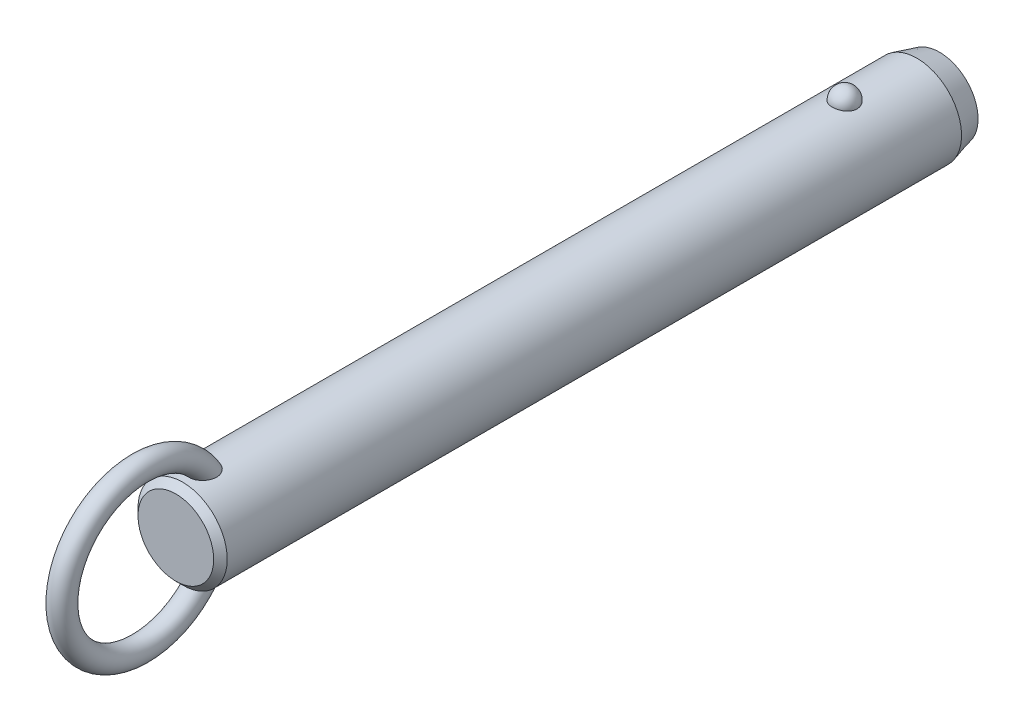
ISO-10303-21;
HEADER;
FILE_DESCRIPTION(('STEP AP214'),'2;1');
FILE_NAME('part.step','',(''),(''),'','','');
FILE_SCHEMA(('AUTOMOTIVE_DESIGN { 1 0 10303 214 1 1 1 1 }'));
ENDSEC;
DATA;
#1=APPLICATION_CONTEXT('core data for automotive mechanical design processes');
#2=APPLICATION_PROTOCOL_DEFINITION('international standard','automotive_design',2000,#1);
#3=PRODUCT_CONTEXT('',#1,'mechanical');
#4=PRODUCT('Part','Part','',(#3));
#5=PRODUCT_RELATED_PRODUCT_CATEGORY('part','',(#4));
#6=PRODUCT_DEFINITION_FORMATION('','',#4);
#7=PRODUCT_DEFINITION_CONTEXT('part definition',#1,'design');
#8=PRODUCT_DEFINITION('design','',#6,#7);
#9=PRODUCT_DEFINITION_SHAPE('','',#8);
#10=(LENGTH_UNIT() NAMED_UNIT(*) SI_UNIT(.MILLI.,.METRE.));
#11=(NAMED_UNIT(*) PLANE_ANGLE_UNIT() SI_UNIT($,.RADIAN.));
#12=(NAMED_UNIT(*) SI_UNIT($,.STERADIAN.) SOLID_ANGLE_UNIT());
#13=UNCERTAINTY_MEASURE_WITH_UNIT(LENGTH_MEASURE(1.E-05),#10,'distance_accuracy_value','');
#14=(GEOMETRIC_REPRESENTATION_CONTEXT(3) GLOBAL_UNCERTAINTY_ASSIGNED_CONTEXT((#13)) GLOBAL_UNIT_ASSIGNED_CONTEXT((#10,
#11,#12)) REPRESENTATION_CONTEXT('',''));
#15=CARTESIAN_POINT('',(0.,0.,0.));
#16=DIRECTION('',(0.,0.,1.));
#17=DIRECTION('',(1.,0.,0.));
#18=AXIS2_PLACEMENT_3D('',#15,#16,#17);
#19=CARTESIAN_POINT('',(0.,0.,106.7));
#20=DIRECTION('',(0.,0.,-1.));
#21=DIRECTION('',(-1.,0.,0.));
#22=AXIS2_PLACEMENT_3D('',#19,#20,#21);
#23=CYLINDRICAL_SURFACE('',#22,7.9);
#24=CARTESIAN_POINT('',(2.1785689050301,7.59367088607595,-2.19999999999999));
#25=CARTESIAN_POINT('',(2.17856679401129,7.59367269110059,-2.07701843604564));
#26=CARTESIAN_POINT('',(2.16853481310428,7.59657145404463,-1.95401006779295));
#27=CARTESIAN_POINT('',(2.12864689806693,7.607843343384,-1.71147811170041));
#28=CARTESIAN_POINT('',(2.09878338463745,7.61621856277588,-1.59195587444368));
#29=CARTESIAN_POINT('',(2.0199931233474,7.63749180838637,-1.3598563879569));
#30=CARTESIAN_POINT('',(1.97107475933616,7.65038784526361,-1.24727610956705));
#31=CARTESIAN_POINT('',(1.85539377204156,7.67926115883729,-1.03213234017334));
#32=CARTESIAN_POINT('',(1.78863158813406,7.69523835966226,-0.929568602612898));
#33=CARTESIAN_POINT('',(1.63856494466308,7.7285848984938,-0.736786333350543));
#34=CARTESIAN_POINT('',(1.55518140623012,7.7459606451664,-0.646630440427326));
#35=CARTESIAN_POINT('',(1.37422937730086,7.78009978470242,-0.481747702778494));
#36=CARTESIAN_POINT('',(1.27666086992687,7.7968631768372,-0.407020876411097));
#37=CARTESIAN_POINT('',(1.07024728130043,7.82786153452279,-0.275278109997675));
#38=CARTESIAN_POINT('',(0.961434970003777,7.84210353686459,-0.218212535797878));
#39=CARTESIAN_POINT('',(0.735351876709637,7.86652194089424,-0.123146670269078));
#40=CARTESIAN_POINT('',(0.618082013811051,7.87669878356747,-0.0851443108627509));
#41=CARTESIAN_POINT('',(0.380637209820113,7.89170521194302,-0.0298158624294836));
#42=CARTESIAN_POINT('',(0.260550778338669,7.89662650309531,-0.0121347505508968));
#43=CARTESIAN_POINT('',(0.0190117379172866,7.90090003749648,0.00324379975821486));
#44=CARTESIAN_POINT('',(-0.10244074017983,7.90025280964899,0.000943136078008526));
#45=CARTESIAN_POINT('',(-0.341452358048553,7.89351056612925,-0.0233955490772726));
#46=CARTESIAN_POINT('',(-0.45904225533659,7.88749257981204,-0.0451545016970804));
#47=CARTESIAN_POINT('',(-0.688796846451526,7.87075812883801,-0.107408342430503));
#48=CARTESIAN_POINT('',(-0.800961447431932,7.86004158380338,-0.147903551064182));
#49=CARTESIAN_POINT('',(-1.01743634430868,7.83497131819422,-0.246799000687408));
#50=CARTESIAN_POINT('',(-1.12169791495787,7.82059709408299,-0.305300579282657));
#51=CARTESIAN_POINT('',(-1.31891765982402,7.78976470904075,-0.438549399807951));
#52=CARTESIAN_POINT('',(-1.41187469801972,7.77330633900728,-0.513298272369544));
#53=CARTESIAN_POINT('',(-1.58577142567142,7.73972434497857,-0.678622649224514));
#54=CARTESIAN_POINT('',(-1.66645140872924,7.72259402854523,-0.769470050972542));
#55=CARTESIAN_POINT('',(-1.81161503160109,7.68983776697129,-0.963538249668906));
#56=CARTESIAN_POINT('',(-1.87609753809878,7.6742119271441,-1.06675991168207));
#57=CARTESIAN_POINT('',(-1.98790138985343,7.6460202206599,-1.28401170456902));
#58=CARTESIAN_POINT('',(-2.03501994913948,7.63349104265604,-1.39815107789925));
#59=CARTESIAN_POINT('',(-2.10986724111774,7.6131449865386,-1.63301784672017));
#60=CARTESIAN_POINT('',(-2.1375965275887,7.60532797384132,-1.75374505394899));
#61=CARTESIAN_POINT('',(-2.17289256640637,7.59531950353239,-1.99782562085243));
#62=CARTESIAN_POINT('',(-2.18054294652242,7.59310471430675,-2.12116592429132));
#63=CARTESIAN_POINT('',(-2.17572919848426,7.59448538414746,-2.36741799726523));
#64=CARTESIAN_POINT('',(-2.1632656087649,7.59808068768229,-2.49032977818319));
#65=CARTESIAN_POINT('',(-2.11865035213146,7.61064035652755,-2.73161015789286));
#66=CARTESIAN_POINT('',(-2.08659579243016,7.61957823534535,-2.84999812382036));
#67=CARTESIAN_POINT('',(-2.00367799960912,7.64179982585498,-3.07955956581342));
#68=CARTESIAN_POINT('',(-1.9528140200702,7.65508371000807,-3.19073275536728));
#69=CARTESIAN_POINT('',(-1.83321113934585,7.68460381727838,-3.40337899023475));
#70=CARTESIAN_POINT('',(-1.76437735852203,7.70085556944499,-3.50479651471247));
#71=CARTESIAN_POINT('',(-1.61069526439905,7.73445734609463,-3.69446912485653));
#72=CARTESIAN_POINT('',(-1.52584634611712,7.75180741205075,-3.78272371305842));
#73=CARTESIAN_POINT('',(-1.34198059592,7.78574608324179,-3.94393987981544));
#74=CARTESIAN_POINT('',(-1.24291308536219,7.80233167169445,-4.01684434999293));
#75=CARTESIAN_POINT('',(-1.03352039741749,7.83281625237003,-4.14489386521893));
#76=CARTESIAN_POINT('',(-0.923196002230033,7.84671543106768,-4.20004014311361));
#77=CARTESIAN_POINT('',(-0.695822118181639,7.87011575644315,-4.29042017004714));
#78=CARTESIAN_POINT('',(-0.578872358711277,7.87966903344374,-4.32589112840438));
#79=CARTESIAN_POINT('',(-0.340410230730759,7.8935652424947,-4.37692226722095));
#80=CARTESIAN_POINT('',(-0.218898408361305,7.89790879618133,-4.39248482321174));
#81=CARTESIAN_POINT('',(0.0228107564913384,7.90087453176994,-4.40314405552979));
#82=CARTESIAN_POINT('',(0.142990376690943,7.89960185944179,-4.39861683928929));
#83=CARTESIAN_POINT('',(0.380829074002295,7.89171262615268,-4.37008293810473));
#84=CARTESIAN_POINT('',(0.498488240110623,7.8850962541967,-4.34607694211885));
#85=CARTESIAN_POINT('',(0.727535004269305,7.86726442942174,-4.27939317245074));
#86=CARTESIAN_POINT('',(0.838944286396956,7.85606616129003,-4.236785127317));
#87=CARTESIAN_POINT('',(1.05295421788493,7.83025654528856,-4.13408348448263));
#88=CARTESIAN_POINT('',(1.15555431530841,7.81564498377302,-4.07398879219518));
#89=CARTESIAN_POINT('',(1.35076763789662,7.7843022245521,-3.93687432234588));
#90=CARTESIAN_POINT('',(1.4432046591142,7.76754209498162,-3.85961036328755));
#91=CARTESIAN_POINT('',(1.6139111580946,7.73387857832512,-3.69076949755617));
#92=CARTESIAN_POINT('',(1.6921781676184,7.71697516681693,-3.59919010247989));
#93=CARTESIAN_POINT('',(1.83380875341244,7.6845643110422,-3.40247278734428));
#94=CARTESIAN_POINT('',(1.89689280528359,7.66908588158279,-3.29712873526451));
#95=CARTESIAN_POINT('',(2.0047823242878,7.64159441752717,-3.07707931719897));
#96=CARTESIAN_POINT('',(2.0495945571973,7.62958010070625,-2.96237743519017));
#97=CARTESIAN_POINT('',(2.11580183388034,7.61146617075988,-2.74040519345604));
#98=CARTESIAN_POINT('',(2.13929812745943,7.60484503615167,-2.63379846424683));
#99=CARTESIAN_POINT('',(2.17068242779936,7.59594664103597,-2.41813481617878));
#100=CARTESIAN_POINT('',(2.17857077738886,7.59366928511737,-2.30907795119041));
#101=CARTESIAN_POINT('',(2.1785689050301,7.59367088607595,-2.19999999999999));
#102=B_SPLINE_CURVE_WITH_KNOTS('',3,(#24,#25,#26,#27,#28,#29,#30,#31,#32,#33,#34,#35,#36,#37,
#38,#39,#40,#41,#42,#43,#44,#45,#46,#47,#48,#49,#50,#51,#52,#53,#54,#55,#56,#57,#58,#59,#60,#61,
#62,#63,#64,#65,#66,#67,#68,#69,#70,#71,#72,#73,#74,#75,#76,#77,#78,#79,#80,#81,#82,#83,#84,#85,
#86,#87,#88,#89,#90,#91,#92,#93,#94,#95,#96,#97,#98,#99,#100,#101),.UNSPECIFIED.,.T.,.F.,(4,2,2,
2,2,2,2,2,2,2,2,2,2,2,2,2,2,2,2,2,2,2,2,2,2,2,2,2,2,2,2,2,2,2,2,2,2,2,4),(0.,0.368552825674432,
0.737246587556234,1.10577831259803,1.4743009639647,1.84462067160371,2.21494081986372,
2.58421058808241,2.95344028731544,3.31611630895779,3.67875788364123,4.03628044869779,
4.39380913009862,4.75338791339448,5.11300280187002,5.47939989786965,5.8458226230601,
6.21639834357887,6.58696347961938,6.95598276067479,7.32499216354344,7.69218715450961,
8.0593967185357,8.42858578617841,8.79778880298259,9.16834203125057,9.5388695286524,
9.90482699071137,10.2707407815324,10.6298333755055,10.9889132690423,11.3466585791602,
11.7044262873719,12.0676511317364,12.4309391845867,12.8004764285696,13.1698767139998,
13.4967701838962,13.8236564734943),.UNSPECIFIED.);
#103=CARTESIAN_POINT('',(2.1785689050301,7.59367088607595,-2.19999999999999));
#104=VERTEX_POINT('',#103);
#105=EDGE_CURVE('E41',#104,#104,#102,.T.);
#106=ORIENTED_EDGE('',*,*,#105,.T.);
#107=EDGE_LOOP('',(#106));
#108=FACE_BOUND('',#107,.T.);
#109=CARTESIAN_POINT('',(0.,0.,115.02));
#110=DIRECTION('',(0.,0.,1.));
#111=DIRECTION('',(1.,0.,0.));
#112=AXIS2_PLACEMENT_3D('',#109,#110,#111);
#113=CIRCLE('',#112,7.9);
#114=CARTESIAN_POINT('',(7.9,0.,115.02));
#115=VERTEX_POINT('',#114);
#116=EDGE_CURVE('E10',#115,#115,#113,.F.);
#117=ORIENTED_EDGE('',*,*,#116,.T.);
#118=EDGE_LOOP('',(#117));
#119=FACE_BOUND('',#118,.T.);
#120=CARTESIAN_POINT('',(-0.630969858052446,-7.87476203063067,108.912432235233));
#121=CARTESIAN_POINT('',(-0.734180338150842,-7.8664899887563,108.947285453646));
#122=CARTESIAN_POINT('',(-0.834476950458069,-7.85639291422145,108.990816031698));
#123=CARTESIAN_POINT('',(-1.0262035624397,-7.83366343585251,109.094094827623));
#124=CARTESIAN_POINT('',(-1.1176141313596,-7.82102565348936,109.153877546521));
#125=CARTESIAN_POINT('',(-1.28877277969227,-7.79464922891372,109.287839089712));
#126=CARTESIAN_POINT('',(-1.36854014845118,-7.78091246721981,109.361993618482));
#127=CARTESIAN_POINT('',(-1.5146152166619,-7.75380398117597,109.522494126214));
#128=CARTESIAN_POINT('',(-1.58092966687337,-7.74043207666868,109.608833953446));
#129=CARTESIAN_POINT('',(-1.70019064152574,-7.71512522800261,109.792978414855));
#130=CARTESIAN_POINT('',(-1.75284037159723,-7.70322473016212,109.890979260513));
#131=CARTESIAN_POINT('',(-1.84263464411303,-7.68224112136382,110.094102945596));
#132=CARTESIAN_POINT('',(-1.87977299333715,-7.6731591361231,110.199228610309));
#133=CARTESIAN_POINT('',(-1.94152728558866,-7.65777930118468,110.423284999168));
#134=CARTESIAN_POINT('',(-1.96475471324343,-7.65179654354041,110.542616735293));
#135=CARTESIAN_POINT('',(-1.99449499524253,-7.64409642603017,110.78342986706));
#136=CARTESIAN_POINT('',(-2.0010005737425,-7.64238092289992,110.904912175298));
#137=CARTESIAN_POINT('',(-1.99856014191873,-7.64302120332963,111.168340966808));
#138=CARTESIAN_POINT('',(-1.98680021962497,-7.64611845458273,111.31025654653));
#139=CARTESIAN_POINT('',(-1.94457772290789,-7.65696186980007,111.591118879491));
#140=CARTESIAN_POINT('',(-1.91409393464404,-7.66471330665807,111.730062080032));
#141=CARTESIAN_POINT('',(-1.82768670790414,-7.68582947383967,112.031939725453));
#142=CARTESIAN_POINT('',(-1.76772963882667,-7.70003779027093,112.193686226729));
#143=CARTESIAN_POINT('',(-1.65998501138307,-7.72371550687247,112.427695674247));
#144=CARTESIAN_POINT('',(-1.621079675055,-7.73200670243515,112.504297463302));
#145=CARTESIAN_POINT('',(-1.53727726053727,-7.74910377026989,112.654079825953));
#146=CARTESIAN_POINT('',(-1.49238215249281,-7.75790947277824,112.727261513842));
#147=CARTESIAN_POINT('',(-1.3739705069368,-7.77993338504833,112.90288382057));
#148=CARTESIAN_POINT('',(-1.29690364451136,-7.79328473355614,113.002955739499));
#149=CARTESIAN_POINT('',(-1.12885487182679,-7.81939266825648,113.190714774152));
#150=CARTESIAN_POINT('',(-1.03789926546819,-7.83215032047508,113.278424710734));
#151=CARTESIAN_POINT('',(-0.869532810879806,-7.85231710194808,113.413414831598));
#152=CARTESIAN_POINT('',(-0.795716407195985,-7.86021093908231,113.465076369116));
#153=CARTESIAN_POINT('',(-0.640813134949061,-7.87434920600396,113.556381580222));
#154=CARTESIAN_POINT('',(-0.559737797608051,-7.88059619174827,113.59604389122));
#155=CARTESIAN_POINT('',(-0.406456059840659,-7.88984116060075,113.654300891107));
#156=CARTESIAN_POINT('',(-0.335227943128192,-7.89321892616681,113.675384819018));
#157=CARTESIAN_POINT('',(-0.190193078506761,-7.89804235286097,113.70541418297));
#158=CARTESIAN_POINT('',(-0.116388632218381,-7.89948969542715,113.714370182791));
#159=CARTESIAN_POINT('',(0.0318414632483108,-7.90028409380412,113.719291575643));
#160=CARTESIAN_POINT('',(0.106268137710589,-7.89962640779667,113.715227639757));
#161=CARTESIAN_POINT('',(0.253290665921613,-7.8962818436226,113.694461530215));
#162=CARTESIAN_POINT('',(0.32588518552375,-7.8935935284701,113.677750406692));
#163=CARTESIAN_POINT('',(0.481441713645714,-7.88577340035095,113.628738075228));
#164=CARTESIAN_POINT('',(0.563611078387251,-7.88026321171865,113.594005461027));
#165=CARTESIAN_POINT('',(0.721129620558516,-7.86741729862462,113.511796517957));
#166=CARTESIAN_POINT('',(0.796466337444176,-7.86007832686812,113.464297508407));
#167=CARTESIAN_POINT('',(0.971456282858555,-7.84073285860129,113.336513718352));
#168=CARTESIAN_POINT('',(1.06719686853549,-7.82809461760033,113.251004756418));
#169=CARTESIAN_POINT('',(1.24418921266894,-7.80192439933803,113.066232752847));
#170=CARTESIAN_POINT('',(1.32540832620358,-7.78839049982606,112.966939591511));
#171=CARTESIAN_POINT('',(1.45199971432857,-7.76559693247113,112.789576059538));
#172=CARTESIAN_POINT('',(1.5008564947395,-7.75626094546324,112.713954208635));
#173=CARTESIAN_POINT('',(1.59197749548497,-7.7380727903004,112.558742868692));
#174=CARTESIAN_POINT('',(1.63423919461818,-7.72922080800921,112.479151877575));
#175=CARTESIAN_POINT('',(1.71222612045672,-7.71231959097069,112.316664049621));
#176=CARTESIAN_POINT('',(1.7479451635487,-7.70427111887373,112.233764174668));
#177=CARTESIAN_POINT('',(1.81270113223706,-7.68929240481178,112.065296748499));
#178=CARTESIAN_POINT('',(1.84173789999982,-7.68236218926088,111.979729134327));
#179=CARTESIAN_POINT('',(1.89322698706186,-7.6698375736,111.80528702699));
#180=CARTESIAN_POINT('',(1.91558744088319,-7.66426199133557,111.716383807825));
#181=CARTESIAN_POINT('',(1.95281367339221,-7.65485915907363,111.536969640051));
#182=CARTESIAN_POINT('',(1.96767946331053,-7.65103190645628,111.446458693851));
#183=CARTESIAN_POINT('',(2.00021456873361,-7.64262981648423,111.173732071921));
#184=CARTESIAN_POINT('',(2.00600691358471,-7.6410871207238,110.989709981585));
#185=CARTESIAN_POINT('',(1.98445334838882,-7.64669564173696,110.676501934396));
#186=CARTESIAN_POINT('',(1.96607186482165,-7.65149688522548,110.546618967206));
#187=CARTESIAN_POINT('',(1.90884967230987,-7.6659762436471,110.291632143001));
#188=CARTESIAN_POINT('',(1.87002101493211,-7.67565148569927,110.166525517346));
#189=CARTESIAN_POINT('',(1.77063986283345,-7.69918471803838,109.92454013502));
#190=CARTESIAN_POINT('',(1.7099372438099,-7.71307150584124,109.807725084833));
#191=CARTESIAN_POINT('',(1.56733070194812,-7.74330306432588,109.588144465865));
#192=CARTESIAN_POINT('',(1.48543692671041,-7.75964665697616,109.485372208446));
#193=CARTESIAN_POINT('',(1.31346177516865,-7.79047523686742,109.309380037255));
#194=CARTESIAN_POINT('',(1.22547278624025,-7.80495298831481,109.234106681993));
#195=CARTESIAN_POINT('',(1.03724352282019,-7.83218597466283,109.100486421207));
#196=CARTESIAN_POINT('',(0.937008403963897,-7.84494192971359,109.042132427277));
#197=CARTESIAN_POINT('',(0.733599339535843,-7.86649045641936,108.947027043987));
#198=CARTESIAN_POINT('',(0.630941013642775,-7.87547134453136,108.909210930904));
#199=CARTESIAN_POINT('',(0.420465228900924,-7.88950708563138,108.851116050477));
#200=CARTESIAN_POINT('',(0.312645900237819,-7.89456050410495,108.83084369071));
#201=CARTESIAN_POINT('',(0.0960869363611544,-7.9001518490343,108.808455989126));
#202=CARTESIAN_POINT('',(-0.0126341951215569,-7.90073226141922,108.806169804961));
#203=CARTESIAN_POINT('',(-0.228766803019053,-7.89742350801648,108.819367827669));
#204=CARTESIAN_POINT('',(-0.336180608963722,-7.89354403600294,108.834813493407));
#205=CARTESIAN_POINT('',(-0.473410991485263,-7.88586871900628,108.866217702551));
#206=CARTESIAN_POINT('',(-0.5052577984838,-7.88388984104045,108.874354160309));
#207=CARTESIAN_POINT('',(-0.568481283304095,-7.87958326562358,108.892208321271));
#208=CARTESIAN_POINT('',(-0.599857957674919,-7.87725556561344,108.901926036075));
#209=CARTESIAN_POINT('',(-0.630969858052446,-7.87476203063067,108.912432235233));
#210=B_SPLINE_CURVE_WITH_KNOTS('',3,(#120,#121,#122,#123,#124,#125,#126,#127,#128,#129,#130,
#131,#132,#133,#134,#135,#136,#137,#138,#139,#140,#141,#142,#143,#144,#145,#146,#147,#148,#149,
#150,#151,#152,#153,#154,#155,#156,#157,#158,#159,#160,#161,#162,#163,#164,#165,#166,#167,#168,
#169,#170,#171,#172,#173,#174,#175,#176,#177,#178,#179,#180,#181,#182,#183,#184,#185,#186,#187,
#188,#189,#190,#191,#192,#193,#194,#195,#196,#197,#198,#199,#200,#201,#202,#203,#204,#205,#206,
#207,#208,#209),.UNSPECIFIED.,.T.,.F.,(4,2,2,2,2,2,2,2,2,2,2,2,2,2,2,2,2,2,2,2,2,2,2,2,2,2,2,2,
2,2,2,2,2,2,2,2,2,2,2,2,2,2,2,2,4),(0.,0.327622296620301,0.655945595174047,0.983718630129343,
1.3113267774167,1.64554655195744,1.97989964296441,2.3436572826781,2.70757317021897,
3.13333684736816,3.55958380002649,4.07655306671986,4.33527897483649,4.59391999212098,
4.9738243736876,5.35301797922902,5.62348245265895,5.89352465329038,6.11565959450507,
6.3376009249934,6.56004255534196,6.78264174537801,7.04930844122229,7.31645206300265,
7.70130871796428,8.08701995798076,8.35824509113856,8.62957365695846,8.9011573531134,
9.17274746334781,9.44791855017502,9.72308922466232,10.2715298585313,10.6638393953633,
11.0559179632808,11.4507403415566,11.845374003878,12.1936425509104,12.5417649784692,
12.8695063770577,13.1973674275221,13.5221104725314,13.8461490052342,13.9449071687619,
14.0436660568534),.UNSPECIFIED.);
#211=CARTESIAN_POINT('',(-0.630969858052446,-7.87476203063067,108.912432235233));
#212=VERTEX_POINT('',#211);
#213=EDGE_CURVE('E60',#212,#212,#210,.T.);
#214=ORIENTED_EDGE('',*,*,#213,.T.);
#215=EDGE_LOOP('',(#214));
#216=FACE_BOUND('',#215,.T.);
#217=CARTESIAN_POINT('',(-0.630969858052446,7.87476203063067,108.912432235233));
#218=CARTESIAN_POINT('',(-0.52891882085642,7.88293636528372,108.877979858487));
#219=CARTESIAN_POINT('',(-0.423745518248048,7.8893481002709,108.851915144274));
#220=CARTESIAN_POINT('',(-0.210236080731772,7.8979273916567,108.817282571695));
#221=CARTESIAN_POINT('',(-0.101893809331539,7.90008607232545,108.808751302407));
#222=CARTESIAN_POINT('',(0.114660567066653,7.89990877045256,108.809457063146));
#223=CARTESIAN_POINT('',(0.222872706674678,7.89757640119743,108.81867980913));
#224=CARTESIAN_POINT('',(0.436107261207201,7.88867538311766,108.854652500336));
#225=CARTESIAN_POINT('',(0.541131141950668,7.8821087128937,108.88139425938));
#226=CARTESIAN_POINT('',(0.745085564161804,7.86545130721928,108.951756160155));
#227=CARTESIAN_POINT('',(0.844015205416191,7.85536005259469,108.995378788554));
#228=CARTESIAN_POINT('',(1.03299167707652,7.83275153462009,109.098379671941));
#229=CARTESIAN_POINT('',(1.12303841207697,7.8202342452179,109.157758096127));
#230=CARTESIAN_POINT('',(1.29214734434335,7.79408219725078,109.290864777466));
#231=CARTESIAN_POINT('',(1.37116907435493,7.78044359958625,109.364643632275));
#232=CARTESIAN_POINT('',(1.51597677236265,7.75353170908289,109.524235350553));
#233=CARTESIAN_POINT('',(1.58176261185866,7.74025841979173,109.610048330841));
#234=CARTESIAN_POINT('',(1.70057386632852,7.71504069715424,109.793644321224));
#235=CARTESIAN_POINT('',(1.75320073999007,7.7031425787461,109.891690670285));
#236=CARTESIAN_POINT('',(1.8429376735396,7.68216822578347,110.094893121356));
#237=CARTESIAN_POINT('',(1.88004278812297,7.67309289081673,110.200051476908));
#238=CARTESIAN_POINT('',(1.9417232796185,7.6577294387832,110.424167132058));
#239=CARTESIAN_POINT('',(1.96491037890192,7.65175648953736,110.543524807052));
#240=CARTESIAN_POINT('',(1.9945689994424,7.64407702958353,110.784384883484));
#241=CARTESIAN_POINT('',(2.00103304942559,7.64237242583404,110.90588821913));
#242=CARTESIAN_POINT('',(1.9985016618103,7.64303650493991,111.169368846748));
#243=CARTESIAN_POINT('',(1.98669038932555,7.64614714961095,111.311314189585));
#244=CARTESIAN_POINT('',(1.94436120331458,7.6570170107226,111.592228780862));
#245=CARTESIAN_POINT('',(1.91382203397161,7.66478150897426,111.731194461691));
#246=CARTESIAN_POINT('',(1.82728754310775,7.68592483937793,112.033111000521));
#247=CARTESIAN_POINT('',(1.76725778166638,7.7001468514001,112.194872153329));
#248=CARTESIAN_POINT('',(1.65939700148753,7.72384204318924,112.428891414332));
#249=CARTESIAN_POINT('',(1.62045187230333,7.73213852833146,112.505494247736));
#250=CARTESIAN_POINT('',(1.5365668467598,7.74924489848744,112.655273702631));
#251=CARTESIAN_POINT('',(1.49162892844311,7.75805461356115,112.728451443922));
#252=CARTESIAN_POINT('',(1.37317698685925,7.78007342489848,112.903952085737));
#253=CARTESIAN_POINT('',(1.29612360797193,7.79341423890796,113.003911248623));
#254=CARTESIAN_POINT('',(1.12812043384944,7.81949839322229,113.19145083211));
#255=CARTESIAN_POINT('',(1.03719688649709,7.83224280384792,113.279054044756));
#256=CARTESIAN_POINT('',(0.868871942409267,7.85239026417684,113.41389715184));
#257=CARTESIAN_POINT('',(0.795056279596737,7.86027769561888,113.465511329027));
#258=CARTESIAN_POINT('',(0.640160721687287,7.87440222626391,113.556720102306));
#259=CARTESIAN_POINT('',(0.559092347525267,7.88064188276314,113.596333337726));
#260=CARTESIAN_POINT('',(0.405820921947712,7.8898738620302,113.654505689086));
#261=CARTESIAN_POINT('',(0.33459413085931,7.89324577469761,113.675552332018));
#262=CARTESIAN_POINT('',(0.189568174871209,7.89805733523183,113.705507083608));
#263=CARTESIAN_POINT('',(0.115771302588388,7.89949866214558,113.714425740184));
#264=CARTESIAN_POINT('',(-0.032435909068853,7.90028156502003,113.71927589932));
#265=CARTESIAN_POINT('',(-0.106847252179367,7.89961843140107,113.715178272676));
#266=CARTESIAN_POINT('',(-0.253834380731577,7.8962642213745,113.694351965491));
#267=CARTESIAN_POINT('',(-0.326408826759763,7.89357170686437,113.677614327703));
#268=CARTESIAN_POINT('',(-0.481962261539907,7.88574179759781,113.628539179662));
#269=CARTESIAN_POINT('',(-0.564145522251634,7.88022507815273,113.593763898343));
#270=CARTESIAN_POINT('',(-0.721685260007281,7.8673664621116,113.511468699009));
#271=CARTESIAN_POINT('',(-0.797029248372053,7.8600213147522,113.463926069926));
#272=CARTESIAN_POINT('',(-0.972044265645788,7.84066026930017,113.336026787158));
#273=CARTESIAN_POINT('',(-1.06779803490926,7.82801274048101,113.250443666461));
#274=CARTESIAN_POINT('',(-1.24480531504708,7.80182621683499,113.065522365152));
#275=CARTESIAN_POINT('',(-1.32602618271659,7.78828530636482,112.966154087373));
#276=CARTESIAN_POINT('',(-1.45259834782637,7.76548487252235,112.788680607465));
#277=CARTESIAN_POINT('',(-1.50143856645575,7.75614818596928,112.713025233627));
#278=CARTESIAN_POINT('',(-1.59252410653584,7.73796020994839,112.557748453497));
#279=CARTESIAN_POINT('',(-1.63476690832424,7.72910910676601,112.478125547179));
#280=CARTESIAN_POINT('',(-1.71271318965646,7.71221133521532,112.315575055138));
#281=CARTESIAN_POINT('',(-1.74841047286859,7.70416543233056,112.232644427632));
#282=CARTESIAN_POINT('',(-1.81311929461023,7.68919371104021,112.064116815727));
#283=CARTESIAN_POINT('',(-1.84213067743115,7.6822679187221,111.978519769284));
#284=CARTESIAN_POINT('',(-1.89356259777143,7.66975461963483,111.804025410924));
#285=CARTESIAN_POINT('',(-1.91589165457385,7.66418586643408,111.715099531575));
#286=CARTESIAN_POINT('',(-1.95305070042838,7.65479859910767,111.535642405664));
#287=CARTESIAN_POINT('',(-1.96788069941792,7.65098008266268,111.445111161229));
#288=CARTESIAN_POINT('',(-2.00030078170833,7.64260704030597,111.172327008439));
#289=CARTESIAN_POINT('',(-2.00600576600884,7.64108760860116,110.988271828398));
#290=CARTESIAN_POINT('',(-1.98428483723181,7.64673945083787,110.675080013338));
#291=CARTESIAN_POINT('',(-1.96583698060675,7.6515575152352,110.545240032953));
#292=CARTESIAN_POINT('',(-1.90848948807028,7.66606613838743,110.290361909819));
#293=CARTESIAN_POINT('',(-1.86960376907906,7.67575338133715,110.165320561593));
#294=CARTESIAN_POINT('',(-1.7701342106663,7.6993013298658,109.923500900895));
#295=CARTESIAN_POINT('',(-1.70940488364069,7.71318991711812,109.806784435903));
#296=CARTESIAN_POINT('',(-1.56672953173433,7.74342495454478,109.587340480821));
#297=CARTESIAN_POINT('',(-1.48478316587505,7.75977144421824,109.48461321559));
#298=CARTESIAN_POINT('',(-1.31266325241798,7.79061163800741,109.308643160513));
#299=CARTESIAN_POINT('',(-1.22456383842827,7.80509908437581,109.233358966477));
#300=CARTESIAN_POINT('',(-1.03622400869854,7.83231881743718,109.099865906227));
#301=CARTESIAN_POINT('',(-0.936015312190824,7.84505551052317,109.041613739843));
#302=CARTESIAN_POINT('',(-0.798824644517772,7.85957802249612,108.977540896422));
#303=CARTESIAN_POINT('',(-0.765787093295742,7.86286821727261,108.963224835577));
#304=CARTESIAN_POINT('',(-0.69893958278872,7.86909211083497,108.936436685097));
#305=CARTESIAN_POINT('',(-0.665129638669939,7.8720258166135,108.923964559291));
#306=CARTESIAN_POINT('',(-0.630969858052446,7.87476203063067,108.912432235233));
#307=B_SPLINE_CURVE_WITH_KNOTS('',3,(#217,#218,#219,#220,#221,#222,#223,#224,#225,#226,#227,
#228,#229,#230,#231,#232,#233,#234,#235,#236,#237,#238,#239,#240,#241,#242,#243,#244,#245,#246,
#247,#248,#249,#250,#251,#252,#253,#254,#255,#256,#257,#258,#259,#260,#261,#262,#263,#264,#265,
#266,#267,#268,#269,#270,#271,#272,#273,#274,#275,#276,#277,#278,#279,#280,#281,#282,#283,#284,
#285,#286,#287,#288,#289,#290,#291,#292,#293,#294,#295,#296,#297,#298,#299,#300,#301,#302,#303,
#304,#305,#306),.UNSPECIFIED.,.T.,.F.,(4,2,2,2,2,2,2,2,2,2,2,2,2,2,2,2,2,2,2,2,2,2,2,2,2,2,2,2,
2,2,2,2,2,2,2,2,2,2,2,2,2,2,2,2,4),(0.,0.323920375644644,0.648516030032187,0.97285063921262,
1.29703380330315,1.62126473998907,1.94549915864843,2.27089401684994,2.5962920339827,
2.93059633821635,3.26500707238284,3.62881644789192,3.99278833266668,4.41865421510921,
4.84500434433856,5.36209210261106,5.62087589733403,5.87957448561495,6.25918598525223,
6.63808782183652,6.90846748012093,7.17842501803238,7.40052350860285,7.62242871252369,
7.84483086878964,8.06739077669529,8.33414615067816,8.60137921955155,8.98641454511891,
9.37230415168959,9.64358673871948,9.91497268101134,10.1866142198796,10.4582620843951,
10.7334745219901,11.0086865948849,11.5572126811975,11.9494246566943,12.3413699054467,
12.7359755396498,13.1305875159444,13.4791770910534,13.82687259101,13.9353013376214,
14.0437279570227),.UNSPECIFIED.);
#308=CARTESIAN_POINT('',(-0.630969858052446,7.87476203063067,108.912432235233));
#309=VERTEX_POINT('',#308);
#310=EDGE_CURVE('E68',#309,#309,#307,.T.);
#311=ORIENTED_EDGE('',*,*,#310,.T.);
#312=EDGE_LOOP('',(#311));
#313=FACE_BOUND('',#312,.T.);
#314=CARTESIAN_POINT('',(0.,0.,-15.0000000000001));
#315=DIRECTION('',(0.,0.,-1.));
#316=DIRECTION('',(-1.,0.,0.));
#317=AXIS2_PLACEMENT_3D('',#314,#315,#316);
#318=CIRCLE('',#317,7.9);
#319=CARTESIAN_POINT('',(-7.9,0.,-15.0000000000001));
#320=VERTEX_POINT('',#319);
#321=EDGE_CURVE('E57',#320,#320,#318,.F.);
#322=ORIENTED_EDGE('',*,*,#321,.T.);
#323=EDGE_LOOP('',(#322));
#324=FACE_BOUND('',#323,.T.);
#325=ADVANCED_FACE('F37',(#108,#119,#216,#313,#324),#23,.T.);
#326=CARTESIAN_POINT('',(0.,0.,-19.));
#327=DIRECTION('',(0.,0.,-1.));
#328=DIRECTION('',(-1.,0.,0.));
#329=AXIS2_PLACEMENT_3D('',#326,#327,#328);
#330=PLANE('',#329);
#331=CARTESIAN_POINT('',(0.,0.,-19.));
#332=DIRECTION('',(0.,0.,-1.));
#333=DIRECTION('',(-1.,0.,0.));
#334=AXIS2_PLACEMENT_3D('',#331,#332,#333);
#335=CIRCLE('',#334,6.82820323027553);
#336=CARTESIAN_POINT('',(-6.82820323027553,0.,-19.));
#337=VERTEX_POINT('',#336);
#338=EDGE_CURVE('E67',#337,#337,#335,.T.);
#339=ORIENTED_EDGE('',*,*,#338,.T.);
#340=EDGE_LOOP('',(#339));
#341=FACE_BOUND('',#340,.T.);
#342=ADVANCED_FACE('F86',(#341),#330,.T.);
#343=CARTESIAN_POINT('',(0.,0.,-19.));
#344=DIRECTION('',(0.,0.,1.));
#345=DIRECTION('',(1.,0.,0.));
#346=AXIS2_PLACEMENT_3D('',#343,#344,#345);
#347=CONICAL_SURFACE('',#346,6.82820323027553,0.261799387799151);
#348=ORIENTED_EDGE('',*,*,#321,.F.);
#349=EDGE_LOOP('',(#348));
#350=FACE_BOUND('',#349,.T.);
#351=ORIENTED_EDGE('',*,*,#338,.F.);
#352=EDGE_LOOP('',(#351));
#353=FACE_BOUND('',#352,.T.);
#354=ADVANCED_FACE('F84',(#350,#353),#347,.T.);
#355=CARTESIAN_POINT('',(0.,0.,116.22));
#356=DIRECTION('',(0.,0.,1.));
#357=DIRECTION('',(1.,0.,0.));
#358=AXIS2_PLACEMENT_3D('',#355,#356,#357);
#359=PLANE('',#358);
#360=CARTESIAN_POINT('',(0.,0.,116.22));
#361=DIRECTION('',(0.,0.,1.));
#362=DIRECTION('',(1.,0.,0.));
#363=AXIS2_PLACEMENT_3D('',#360,#361,#362);
#364=CIRCLE('',#363,6.70000000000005);
#365=CARTESIAN_POINT('',(6.70000000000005,0.,116.22));
#366=VERTEX_POINT('',#365);
#367=EDGE_CURVE('E50',#366,#366,#364,.T.);
#368=ORIENTED_EDGE('',*,*,#367,.T.);
#369=EDGE_LOOP('',(#368));
#370=FACE_BOUND('',#369,.T.);
#371=ADVANCED_FACE('F78',(#370),#359,.T.);
#372=CARTESIAN_POINT('',(0.,0.,122.55));
#373=DIRECTION('',(1.,0.,0.));
#374=DIRECTION('',(0.,0.,-1.));
#375=AXIS2_PLACEMENT_3D('',#372,#373,#374);
#376=TOROIDAL_SURFACE('',#375,13.85,2.);
#377=ORIENTED_EDGE('',*,*,#310,.F.);
#378=EDGE_LOOP('',(#377));
#379=FACE_BOUND('',#378,.T.);
#380=ORIENTED_EDGE('',*,*,#213,.F.);
#381=EDGE_LOOP('',(#380));
#382=FACE_BOUND('',#381,.T.);
#383=ADVANCED_FACE('F74',(#379,#382),#376,.T.);
#384=CARTESIAN_POINT('',(0.,0.,116.22));
#385=DIRECTION('',(0.,0.,-1.));
#386=DIRECTION('',(-1.,0.,0.));
#387=AXIS2_PLACEMENT_3D('',#384,#385,#386);
#388=CONICAL_SURFACE('',#387,6.70000000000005,0.785398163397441);
#389=ORIENTED_EDGE('',*,*,#116,.F.);
#390=EDGE_LOOP('',(#389));
#391=FACE_BOUND('',#390,.T.);
#392=ORIENTED_EDGE('',*,*,#367,.F.);
#393=EDGE_LOOP('',(#392));
#394=FACE_BOUND('',#393,.T.);
#395=ADVANCED_FACE('F39',(#391,#394),#388,.T.);
#396=CARTESIAN_POINT('',(0.,7.9,-2.19999999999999));
#397=DIRECTION('',(0.,1.,0.));
#398=DIRECTION('',(0.,0.,1.));
#399=AXIS2_PLACEMENT_3D('',#396,#397,#398);
#400=SPHERICAL_SURFACE('',#399,2.2);
#401=ORIENTED_EDGE('',*,*,#105,.F.);
#402=EDGE_LOOP('',(#401));
#403=FACE_BOUND('',#402,.T.);
#404=ADVANCED_FACE('F80',(#403),#400,.T.);
#405=CLOSED_SHELL('',(#325,#342,#354,#371,#383,#395,#404));
#406=MANIFOLD_SOLID_BREP('B2',#405);
#407=ADVANCED_BREP_SHAPE_REPRESENTATION('',(#18,#406),#14);
#408=SHAPE_DEFINITION_REPRESENTATION(#9,#407);
ENDSEC;
END-ISO-10303-21;
